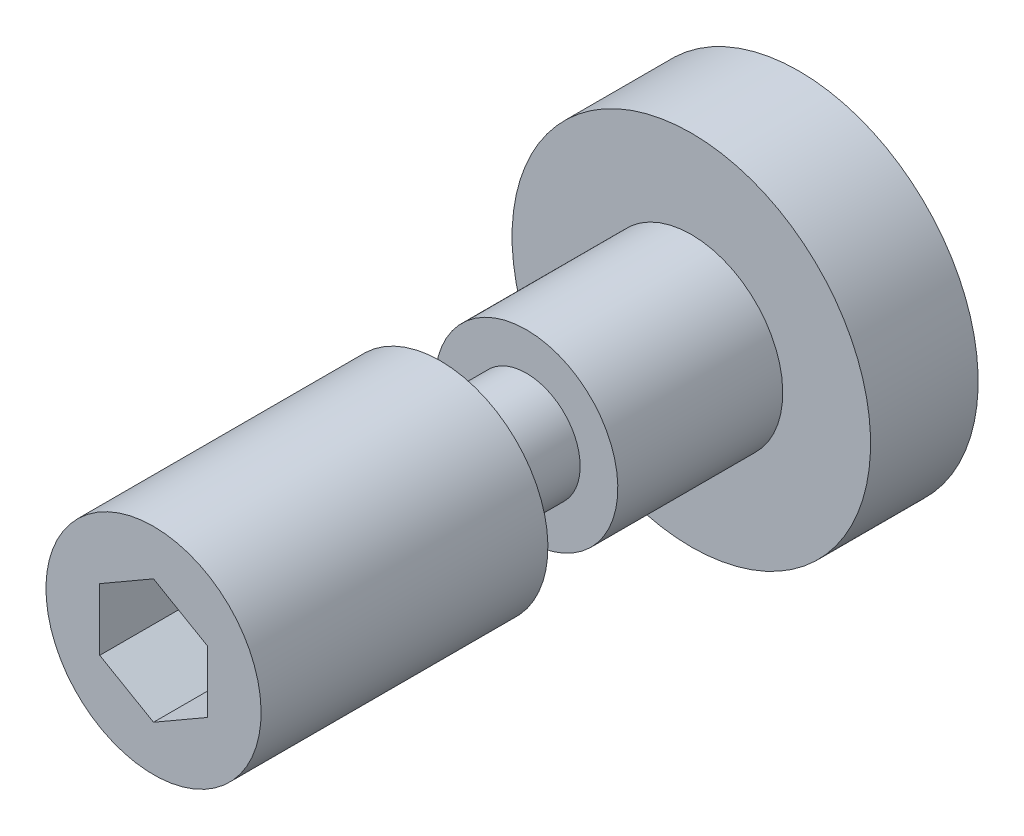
ISO-10303-21;
HEADER;
FILE_DESCRIPTION(('STEP AP214'),'2;1');
FILE_NAME('part.step','',(''),(''),'','','');
FILE_SCHEMA(('AUTOMOTIVE_DESIGN { 1 0 10303 214 1 1 1 1 }'));
ENDSEC;
DATA;
#1=APPLICATION_CONTEXT('core data for automotive mechanical design processes');
#2=APPLICATION_PROTOCOL_DEFINITION('international standard','automotive_design',2000,#1);
#3=PRODUCT_CONTEXT('',#1,'mechanical');
#4=PRODUCT('Part','Part','',(#3));
#5=PRODUCT_RELATED_PRODUCT_CATEGORY('part','',(#4));
#6=PRODUCT_DEFINITION_FORMATION('','',#4);
#7=PRODUCT_DEFINITION_CONTEXT('part definition',#1,'design');
#8=PRODUCT_DEFINITION('design','',#6,#7);
#9=PRODUCT_DEFINITION_SHAPE('','',#8);
#10=(LENGTH_UNIT() NAMED_UNIT(*) SI_UNIT(.MILLI.,.METRE.));
#11=(NAMED_UNIT(*) PLANE_ANGLE_UNIT() SI_UNIT($,.RADIAN.));
#12=(NAMED_UNIT(*) SI_UNIT($,.STERADIAN.) SOLID_ANGLE_UNIT());
#13=UNCERTAINTY_MEASURE_WITH_UNIT(LENGTH_MEASURE(1.E-05),#10,'distance_accuracy_value','');
#14=(GEOMETRIC_REPRESENTATION_CONTEXT(3) GLOBAL_UNCERTAINTY_ASSIGNED_CONTEXT((#13)) GLOBAL_UNIT_ASSIGNED_CONTEXT((#10,
#11,#12)) REPRESENTATION_CONTEXT('',''));
#15=CARTESIAN_POINT('',(0.,0.,0.));
#16=DIRECTION('',(0.,0.,1.));
#17=DIRECTION('',(1.,0.,0.));
#18=AXIS2_PLACEMENT_3D('',#15,#16,#17);
#19=CARTESIAN_POINT('',(0.,0.,0.));
#20=DIRECTION('',(0.,0.,1.));
#21=DIRECTION('',(0.,1.,0.));
#22=AXIS2_PLACEMENT_3D('',#19,#20,#21);
#23=PLANE('',#22);
#24=CARTESIAN_POINT('',(0.,0.,0.));
#25=DIRECTION('',(0.,0.,1.));
#26=DIRECTION('',(0.,1.,0.));
#27=AXIS2_PLACEMENT_3D('',#24,#25,#26);
#28=CIRCLE('',#27,5.);
#29=CARTESIAN_POINT('',(0.,5.,0.));
#30=VERTEX_POINT('',#29);
#31=EDGE_CURVE('E9',#30,#30,#28,.T.);
#32=ORIENTED_EDGE('',*,*,#31,.F.);
#33=EDGE_LOOP('',(#32));
#34=FACE_BOUND('',#33,.T.);
#35=ADVANCED_FACE('F14',(#34),#23,.F.);
#36=CARTESIAN_POINT('',(0.,0.,40.));
#37=DIRECTION('',(0.,0.,1.));
#38=DIRECTION('',(0.,1.,0.));
#39=AXIS2_PLACEMENT_3D('',#36,#37,#38);
#40=CYLINDRICAL_SURFACE('',#39,5.);
#41=CARTESIAN_POINT('',(0.,0.,3.));
#42=DIRECTION('',(0.,0.,1.));
#43=DIRECTION('',(0.,1.,0.));
#44=AXIS2_PLACEMENT_3D('',#41,#42,#43);
#45=CIRCLE('',#44,5.);
#46=CARTESIAN_POINT('',(0.,5.,3.));
#47=VERTEX_POINT('',#46);
#48=EDGE_CURVE('E21',#47,#47,#45,.T.);
#49=ORIENTED_EDGE('',*,*,#48,.F.);
#50=EDGE_LOOP('',(#49));
#51=FACE_BOUND('',#50,.T.);
#52=ORIENTED_EDGE('',*,*,#31,.T.);
#53=EDGE_LOOP('',(#52));
#54=FACE_BOUND('',#53,.T.);
#55=ADVANCED_FACE('F142',(#51,#54),#40,.T.);
#56=CARTESIAN_POINT('',(0.,-5.,3.));
#57=DIRECTION('',(0.,0.,-1.));
#58=DIRECTION('',(0.,-1.,0.));
#59=AXIS2_PLACEMENT_3D('',#56,#57,#58);
#60=PLANE('',#59);
#61=CARTESIAN_POINT('',(0.,0.,3.));
#62=DIRECTION('',(0.,0.,1.));
#63=DIRECTION('',(0.,1.,0.));
#64=AXIS2_PLACEMENT_3D('',#61,#62,#63);
#65=CIRCLE('',#64,2.55);
#66=CARTESIAN_POINT('',(0.,2.55,3.));
#67=VERTEX_POINT('',#66);
#68=EDGE_CURVE('E135',#67,#67,#65,.T.);
#69=ORIENTED_EDGE('',*,*,#68,.F.);
#70=EDGE_LOOP('',(#69));
#71=FACE_BOUND('',#70,.T.);
#72=ORIENTED_EDGE('',*,*,#48,.T.);
#73=EDGE_LOOP('',(#72));
#74=FACE_BOUND('',#73,.T.);
#75=ADVANCED_FACE('F140',(#71,#74),#60,.F.);
#76=CARTESIAN_POINT('',(0.,0.,40.));
#77=DIRECTION('',(0.,0.,1.));
#78=DIRECTION('',(0.,1.,0.));
#79=AXIS2_PLACEMENT_3D('',#76,#77,#78);
#80=CYLINDRICAL_SURFACE('',#79,2.55);
#81=CARTESIAN_POINT('',(0.,0.,7.6));
#82=DIRECTION('',(0.,0.,1.));
#83=DIRECTION('',(0.,1.,0.));
#84=AXIS2_PLACEMENT_3D('',#81,#82,#83);
#85=CIRCLE('',#84,2.55);
#86=CARTESIAN_POINT('',(0.,2.55,7.6));
#87=VERTEX_POINT('',#86);
#88=EDGE_CURVE('E132',#87,#87,#85,.T.);
#89=ORIENTED_EDGE('',*,*,#88,.F.);
#90=EDGE_LOOP('',(#89));
#91=FACE_BOUND('',#90,.T.);
#92=ORIENTED_EDGE('',*,*,#68,.T.);
#93=EDGE_LOOP('',(#92));
#94=FACE_BOUND('',#93,.T.);
#95=ADVANCED_FACE('F165',(#91,#94),#80,.T.);
#96=CARTESIAN_POINT('',(0.,-2.55,7.6));
#97=DIRECTION('',(0.,0.,-1.));
#98=DIRECTION('',(0.,-1.,0.));
#99=AXIS2_PLACEMENT_3D('',#96,#97,#98);
#100=PLANE('',#99);
#101=CARTESIAN_POINT('',(0.,0.,7.6));
#102=DIRECTION('',(0.,0.,1.));
#103=DIRECTION('',(0.,1.,0.));
#104=AXIS2_PLACEMENT_3D('',#101,#102,#103);
#105=CIRCLE('',#104,1.5);
#106=CARTESIAN_POINT('',(0.,1.5,7.6));
#107=VERTEX_POINT('',#106);
#108=EDGE_CURVE('E129',#107,#107,#105,.T.);
#109=ORIENTED_EDGE('',*,*,#108,.F.);
#110=EDGE_LOOP('',(#109));
#111=FACE_BOUND('',#110,.T.);
#112=ORIENTED_EDGE('',*,*,#88,.T.);
#113=EDGE_LOOP('',(#112));
#114=FACE_BOUND('',#113,.T.);
#115=ADVANCED_FACE('F174',(#111,#114),#100,.F.);
#116=CARTESIAN_POINT('',(0.,0.,40.));
#117=DIRECTION('',(0.,0.,1.));
#118=DIRECTION('',(0.,1.,0.));
#119=AXIS2_PLACEMENT_3D('',#116,#117,#118);
#120=CYLINDRICAL_SURFACE('',#119,1.5);
#121=CARTESIAN_POINT('',(0.,0.,10.));
#122=DIRECTION('',(0.,0.,1.));
#123=DIRECTION('',(0.,1.,0.));
#124=AXIS2_PLACEMENT_3D('',#121,#122,#123);
#125=CIRCLE('',#124,1.5);
#126=CARTESIAN_POINT('',(0.,1.5,10.));
#127=VERTEX_POINT('',#126);
#128=EDGE_CURVE('E126',#127,#127,#125,.T.);
#129=ORIENTED_EDGE('',*,*,#128,.F.);
#130=EDGE_LOOP('',(#129));
#131=FACE_BOUND('',#130,.T.);
#132=ORIENTED_EDGE('',*,*,#108,.T.);
#133=EDGE_LOOP('',(#132));
#134=FACE_BOUND('',#133,.T.);
#135=ADVANCED_FACE('F183',(#131,#134),#120,.T.);
#136=CARTESIAN_POINT('',(0.,-1.5,10.));
#137=DIRECTION('',(0.,0.,1.));
#138=DIRECTION('',(0.,1.,0.));
#139=AXIS2_PLACEMENT_3D('',#136,#137,#138);
#140=PLANE('',#139);
#141=CARTESIAN_POINT('',(0.,0.,10.));
#142=DIRECTION('',(0.,0.,1.));
#143=DIRECTION('',(0.,1.,0.));
#144=AXIS2_PLACEMENT_3D('',#141,#142,#143);
#145=CIRCLE('',#144,3.);
#146=CARTESIAN_POINT('',(0.,3.,10.));
#147=VERTEX_POINT('',#146);
#148=EDGE_CURVE('E123',#147,#147,#145,.T.);
#149=ORIENTED_EDGE('',*,*,#148,.F.);
#150=EDGE_LOOP('',(#149));
#151=FACE_BOUND('',#150,.T.);
#152=ORIENTED_EDGE('',*,*,#128,.T.);
#153=EDGE_LOOP('',(#152));
#154=FACE_BOUND('',#153,.T.);
#155=ADVANCED_FACE('F192',(#151,#154),#140,.F.);
#156=CARTESIAN_POINT('',(0.,0.,40.));
#157=DIRECTION('',(0.,0.,1.));
#158=DIRECTION('',(0.,1.,0.));
#159=AXIS2_PLACEMENT_3D('',#156,#157,#158);
#160=CYLINDRICAL_SURFACE('',#159,3.);
#161=CARTESIAN_POINT('',(0.,0.,18.));
#162=DIRECTION('',(0.,0.,1.));
#163=DIRECTION('',(0.,1.,0.));
#164=AXIS2_PLACEMENT_3D('',#161,#162,#163);
#165=CIRCLE('',#164,3.);
#166=CARTESIAN_POINT('',(0.,3.,18.));
#167=VERTEX_POINT('',#166);
#168=EDGE_CURVE('E115',#167,#167,#165,.T.);
#169=ORIENTED_EDGE('',*,*,#168,.F.);
#170=EDGE_LOOP('',(#169));
#171=FACE_BOUND('',#170,.T.);
#172=ORIENTED_EDGE('',*,*,#148,.T.);
#173=EDGE_LOOP('',(#172));
#174=FACE_BOUND('',#173,.T.);
#175=ADVANCED_FACE('F201',(#171,#174),#160,.T.);
#176=CARTESIAN_POINT('',(0.,-3.,18.));
#177=DIRECTION('',(0.,0.,-1.));
#178=DIRECTION('',(0.,-1.,0.));
#179=AXIS2_PLACEMENT_3D('',#176,#177,#178);
#180=PLANE('',#179);
#181=DIRECTION('',(-0.866025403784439,-0.5,0.));
#182=VECTOR('',#181,1.);
#183=CARTESIAN_POINT('',(0.,1.73205080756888,18.));
#184=LINE('',#183,#182);
#185=CARTESIAN_POINT('',(0.,1.73205080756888,18.));
#186=VERTEX_POINT('',#185);
#187=CARTESIAN_POINT('',(-1.5,0.866025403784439,18.));
#188=VERTEX_POINT('',#187);
#189=EDGE_CURVE('E102',#186,#188,#184,.T.);
#190=ORIENTED_EDGE('',*,*,#189,.F.);
#191=DIRECTION('',(-0.866025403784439,0.5,0.));
#192=VECTOR('',#191,1.);
#193=CARTESIAN_POINT('',(1.5,0.86602540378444,18.));
#194=LINE('',#193,#192);
#195=CARTESIAN_POINT('',(1.5,0.86602540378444,18.));
#196=VERTEX_POINT('',#195);
#197=EDGE_CURVE('E28',#196,#186,#194,.T.);
#198=ORIENTED_EDGE('',*,*,#197,.F.);
#199=DIRECTION('',(0.,1.,0.));
#200=VECTOR('',#199,1.);
#201=CARTESIAN_POINT('',(1.5,-0.866025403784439,18.));
#202=LINE('',#201,#200);
#203=CARTESIAN_POINT('',(1.5,-0.866025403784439,18.));
#204=VERTEX_POINT('',#203);
#205=EDGE_CURVE('E111',#204,#196,#202,.T.);
#206=ORIENTED_EDGE('',*,*,#205,.F.);
#207=DIRECTION('',(0.866025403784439,0.5,0.));
#208=VECTOR('',#207,1.);
#209=CARTESIAN_POINT('',(0.,-1.73205080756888,18.));
#210=LINE('',#209,#208);
#211=CARTESIAN_POINT('',(0.,-1.73205080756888,18.));
#212=VERTEX_POINT('',#211);
#213=EDGE_CURVE('E109',#212,#204,#210,.T.);
#214=ORIENTED_EDGE('',*,*,#213,.F.);
#215=DIRECTION('',(0.866025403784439,-0.5,0.));
#216=VECTOR('',#215,1.);
#217=CARTESIAN_POINT('',(-1.5,-0.866025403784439,18.));
#218=LINE('',#217,#216);
#219=CARTESIAN_POINT('',(-1.5,-0.866025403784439,18.));
#220=VERTEX_POINT('',#219);
#221=EDGE_CURVE('E76',#220,#212,#218,.T.);
#222=ORIENTED_EDGE('',*,*,#221,.F.);
#223=DIRECTION('',(0.,-1.,0.));
#224=VECTOR('',#223,1.);
#225=CARTESIAN_POINT('',(-1.5,0.866025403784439,18.));
#226=LINE('',#225,#224);
#227=EDGE_CURVE('E105',#188,#220,#226,.T.);
#228=ORIENTED_EDGE('',*,*,#227,.F.);
#229=EDGE_LOOP('',(#190,#198,#206,#214,#222,#228));
#230=FACE_BOUND('',#229,.T.);
#231=ORIENTED_EDGE('',*,*,#168,.T.);
#232=EDGE_LOOP('',(#231));
#233=FACE_BOUND('',#232,.T.);
#234=ADVANCED_FACE('F210',(#230,#233),#180,.F.);
#235=CARTESIAN_POINT('',(1.5,0.86602540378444,14.));
#236=DIRECTION('',(0.5,0.866025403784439,0.));
#237=DIRECTION('',(-0.866025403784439,0.5,0.));
#238=AXIS2_PLACEMENT_3D('',#235,#236,#237);
#239=PLANE('',#238);
#240=ORIENTED_EDGE('',*,*,#197,.T.);
#241=DIRECTION('',(0.,0.,1.));
#242=VECTOR('',#241,1.);
#243=CARTESIAN_POINT('',(0.,1.73205080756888,14.));
#244=LINE('',#243,#242);
#245=CARTESIAN_POINT('',(0.,1.73205080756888,14.));
#246=VERTEX_POINT('',#245);
#247=EDGE_CURVE('E58',#246,#186,#244,.T.);
#248=ORIENTED_EDGE('',*,*,#247,.F.);
#249=DIRECTION('',(-0.866025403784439,0.5,0.));
#250=VECTOR('',#249,1.);
#251=CARTESIAN_POINT('',(1.5,0.86602540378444,14.));
#252=LINE('',#251,#250);
#253=CARTESIAN_POINT('',(1.5,0.86602540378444,14.));
#254=VERTEX_POINT('',#253);
#255=EDGE_CURVE('E113',#254,#246,#252,.T.);
#256=ORIENTED_EDGE('',*,*,#255,.F.);
#257=DIRECTION('',(0.,0.,1.));
#258=VECTOR('',#257,1.);
#259=CARTESIAN_POINT('',(1.5,0.86602540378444,14.));
#260=LINE('',#259,#258);
#261=EDGE_CURVE('E36',#254,#196,#260,.T.);
#262=ORIENTED_EDGE('',*,*,#261,.T.);
#263=EDGE_LOOP('',(#240,#248,#256,#262));
#264=FACE_BOUND('',#263,.T.);
#265=ADVANCED_FACE('F219',(#264),#239,.F.);
#266=CARTESIAN_POINT('',(1.5,-0.866025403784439,14.));
#267=DIRECTION('',(1.,0.,0.));
#268=DIRECTION('',(0.,1.,0.));
#269=AXIS2_PLACEMENT_3D('',#266,#267,#268);
#270=PLANE('',#269);
#271=ORIENTED_EDGE('',*,*,#205,.T.);
#272=ORIENTED_EDGE('',*,*,#261,.F.);
#273=DIRECTION('',(0.,1.,0.));
#274=VECTOR('',#273,1.);
#275=CARTESIAN_POINT('',(1.5,-0.866025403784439,14.));
#276=LINE('',#275,#274);
#277=CARTESIAN_POINT('',(1.5,-0.866025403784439,14.));
#278=VERTEX_POINT('',#277);
#279=EDGE_CURVE('E88',#278,#254,#276,.T.);
#280=ORIENTED_EDGE('',*,*,#279,.F.);
#281=DIRECTION('',(0.,0.,1.));
#282=VECTOR('',#281,1.);
#283=CARTESIAN_POINT('',(1.5,-0.866025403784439,14.));
#284=LINE('',#283,#282);
#285=EDGE_CURVE('E80',#278,#204,#284,.T.);
#286=ORIENTED_EDGE('',*,*,#285,.T.);
#287=EDGE_LOOP('',(#271,#272,#280,#286));
#288=FACE_BOUND('',#287,.T.);
#289=ADVANCED_FACE('F228',(#288),#270,.F.);
#290=CARTESIAN_POINT('',(0.,-1.73205080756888,14.));
#291=DIRECTION('',(0.5,-0.866025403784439,0.));
#292=DIRECTION('',(0.866025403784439,0.5,0.));
#293=AXIS2_PLACEMENT_3D('',#290,#291,#292);
#294=PLANE('',#293);
#295=ORIENTED_EDGE('',*,*,#213,.T.);
#296=ORIENTED_EDGE('',*,*,#285,.F.);
#297=DIRECTION('',(0.866025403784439,0.5,0.));
#298=VECTOR('',#297,1.);
#299=CARTESIAN_POINT('',(0.,-1.73205080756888,14.));
#300=LINE('',#299,#298);
#301=CARTESIAN_POINT('',(0.,-1.73205080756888,14.));
#302=VERTEX_POINT('',#301);
#303=EDGE_CURVE('E84',#302,#278,#300,.T.);
#304=ORIENTED_EDGE('',*,*,#303,.F.);
#305=DIRECTION('',(0.,0.,1.));
#306=VECTOR('',#305,1.);
#307=CARTESIAN_POINT('',(0.,-1.73205080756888,14.));
#308=LINE('',#307,#306);
#309=EDGE_CURVE('E69',#302,#212,#308,.T.);
#310=ORIENTED_EDGE('',*,*,#309,.T.);
#311=EDGE_LOOP('',(#295,#296,#304,#310));
#312=FACE_BOUND('',#311,.T.);
#313=ADVANCED_FACE('F85',(#312),#294,.F.);
#314=CARTESIAN_POINT('',(-1.5,-0.866025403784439,14.));
#315=DIRECTION('',(-0.5,-0.866025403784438,0.));
#316=DIRECTION('',(0.866025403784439,-0.5,0.));
#317=AXIS2_PLACEMENT_3D('',#314,#315,#316);
#318=PLANE('',#317);
#319=ORIENTED_EDGE('',*,*,#221,.T.);
#320=ORIENTED_EDGE('',*,*,#309,.F.);
#321=DIRECTION('',(0.866025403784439,-0.5,0.));
#322=VECTOR('',#321,1.);
#323=CARTESIAN_POINT('',(-1.5,-0.866025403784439,14.));
#324=LINE('',#323,#322);
#325=CARTESIAN_POINT('',(-1.5,-0.866025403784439,14.));
#326=VERTEX_POINT('',#325);
#327=EDGE_CURVE('E73',#326,#302,#324,.T.);
#328=ORIENTED_EDGE('',*,*,#327,.F.);
#329=DIRECTION('',(0.,0.,1.));
#330=VECTOR('',#329,1.);
#331=CARTESIAN_POINT('',(-1.5,-0.866025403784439,14.));
#332=LINE('',#331,#330);
#333=EDGE_CURVE('E81',#326,#220,#332,.T.);
#334=ORIENTED_EDGE('',*,*,#333,.T.);
#335=EDGE_LOOP('',(#319,#320,#328,#334));
#336=FACE_BOUND('',#335,.T.);
#337=ADVANCED_FACE('F71',(#336),#318,.F.);
#338=CARTESIAN_POINT('',(-1.5,0.866025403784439,14.));
#339=DIRECTION('',(-1.,0.,0.));
#340=DIRECTION('',(0.,-1.,0.));
#341=AXIS2_PLACEMENT_3D('',#338,#339,#340);
#342=PLANE('',#341);
#343=ORIENTED_EDGE('',*,*,#227,.T.);
#344=ORIENTED_EDGE('',*,*,#333,.F.);
#345=DIRECTION('',(0.,-1.,0.));
#346=VECTOR('',#345,1.);
#347=CARTESIAN_POINT('',(-1.5,0.866025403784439,14.));
#348=LINE('',#347,#346);
#349=CARTESIAN_POINT('',(-1.5,0.866025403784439,14.));
#350=VERTEX_POINT('',#349);
#351=EDGE_CURVE('E94',#350,#326,#348,.T.);
#352=ORIENTED_EDGE('',*,*,#351,.F.);
#353=DIRECTION('',(0.,0.,1.));
#354=VECTOR('',#353,1.);
#355=CARTESIAN_POINT('',(-1.5,0.866025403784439,14.));
#356=LINE('',#355,#354);
#357=EDGE_CURVE('E118',#350,#188,#356,.T.);
#358=ORIENTED_EDGE('',*,*,#357,.T.);
#359=EDGE_LOOP('',(#343,#344,#352,#358));
#360=FACE_BOUND('',#359,.T.);
#361=ADVANCED_FACE('F250',(#360),#342,.F.);
#362=CARTESIAN_POINT('',(0.,1.73205080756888,14.));
#363=DIRECTION('',(-0.5,0.866025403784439,0.));
#364=DIRECTION('',(-0.866025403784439,-0.5,0.));
#365=AXIS2_PLACEMENT_3D('',#362,#363,#364);
#366=PLANE('',#365);
#367=ORIENTED_EDGE('',*,*,#189,.T.);
#368=ORIENTED_EDGE('',*,*,#357,.F.);
#369=DIRECTION('',(-0.866025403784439,-0.5,0.));
#370=VECTOR('',#369,1.);
#371=CARTESIAN_POINT('',(0.,1.73205080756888,14.));
#372=LINE('',#371,#370);
#373=EDGE_CURVE('E96',#246,#350,#372,.T.);
#374=ORIENTED_EDGE('',*,*,#373,.F.);
#375=ORIENTED_EDGE('',*,*,#247,.T.);
#376=EDGE_LOOP('',(#367,#368,#374,#375));
#377=FACE_BOUND('',#376,.T.);
#378=ADVANCED_FACE('F258',(#377),#366,.F.);
#379=CARTESIAN_POINT('',(0.,1.73205080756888,14.));
#380=DIRECTION('',(0.,0.,1.));
#381=DIRECTION('',(1.,0.,0.));
#382=AXIS2_PLACEMENT_3D('',#379,#380,#381);
#383=PLANE('',#382);
#384=ORIENTED_EDGE('',*,*,#255,.T.);
#385=ORIENTED_EDGE('',*,*,#373,.T.);
#386=ORIENTED_EDGE('',*,*,#351,.T.);
#387=ORIENTED_EDGE('',*,*,#327,.T.);
#388=ORIENTED_EDGE('',*,*,#303,.T.);
#389=ORIENTED_EDGE('',*,*,#279,.T.);
#390=EDGE_LOOP('',(#384,#385,#386,#387,#388,#389));
#391=FACE_BOUND('',#390,.T.);
#392=ADVANCED_FACE('F91',(#391),#383,.T.);
#393=CLOSED_SHELL('',(#35,#55,#75,#95,#115,#135,#155,#175,#234,#265,#289,#313,#337,#361,#378,#392));
#394=MANIFOLD_SOLID_BREP('B1',#393);
#395=ADVANCED_BREP_SHAPE_REPRESENTATION('',(#18,#394),#14);
#396=SHAPE_DEFINITION_REPRESENTATION(#9,#395);
ENDSEC;
END-ISO-10303-21;
